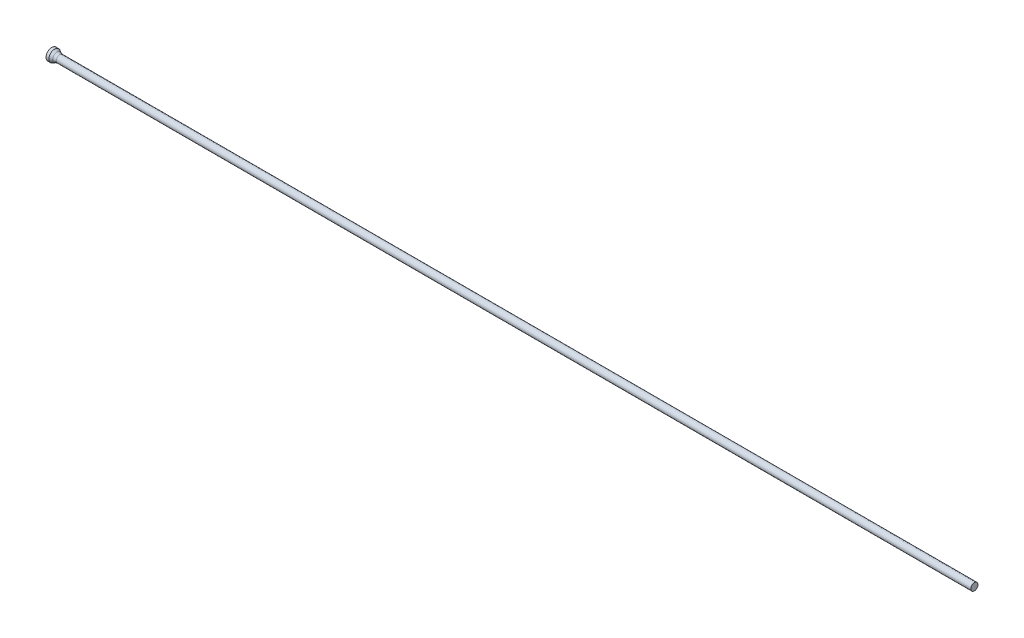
ISO-10303-21;
HEADER;
FILE_DESCRIPTION(('STEP AP214'),'2;1');
FILE_NAME('part.step','',(''),(''),'','','');
FILE_SCHEMA(('AUTOMOTIVE_DESIGN { 1 0 10303 214 1 1 1 1 }'));
ENDSEC;
DATA;
#1=APPLICATION_CONTEXT('core data for automotive mechanical design processes');
#2=APPLICATION_PROTOCOL_DEFINITION('international standard','automotive_design',2000,#1);
#3=PRODUCT_CONTEXT('',#1,'mechanical');
#4=PRODUCT('Part','Part','',(#3));
#5=PRODUCT_RELATED_PRODUCT_CATEGORY('part','',(#4));
#6=PRODUCT_DEFINITION_FORMATION('','',#4);
#7=PRODUCT_DEFINITION_CONTEXT('part definition',#1,'design');
#8=PRODUCT_DEFINITION('design','',#6,#7);
#9=PRODUCT_DEFINITION_SHAPE('','',#8);
#10=(LENGTH_UNIT() NAMED_UNIT(*) SI_UNIT(.MILLI.,.METRE.));
#11=(NAMED_UNIT(*) PLANE_ANGLE_UNIT() SI_UNIT($,.RADIAN.));
#12=(NAMED_UNIT(*) SI_UNIT($,.STERADIAN.) SOLID_ANGLE_UNIT());
#13=UNCERTAINTY_MEASURE_WITH_UNIT(LENGTH_MEASURE(1.E-05),#10,'distance_accuracy_value','');
#14=(GEOMETRIC_REPRESENTATION_CONTEXT(3) GLOBAL_UNCERTAINTY_ASSIGNED_CONTEXT((#13)) GLOBAL_UNIT_ASSIGNED_CONTEXT((#10,
#11,#12)) REPRESENTATION_CONTEXT('',''));
#15=CARTESIAN_POINT('',(0.,0.,0.));
#16=DIRECTION('',(0.,0.,1.));
#17=DIRECTION('',(1.,0.,0.));
#18=AXIS2_PLACEMENT_3D('',#15,#16,#17);
#19=CARTESIAN_POINT('',(0.,0.,0.));
#20=DIRECTION('',(1.,0.,0.));
#21=DIRECTION('',(0.,0.,-1.));
#22=AXIS2_PLACEMENT_3D('',#19,#20,#21);
#23=PLANE('',#22);
#24=CARTESIAN_POINT('',(0.,0.,0.));
#25=DIRECTION('',(-1.,0.,0.));
#26=DIRECTION('',(0.,0.,1.));
#27=AXIS2_PLACEMENT_3D('',#24,#25,#26);
#28=CIRCLE('',#27,1.);
#29=CARTESIAN_POINT('',(0.,0.,1.));
#30=VERTEX_POINT('',#29);
#31=EDGE_CURVE('E25',#30,#30,#28,.T.);
#32=ORIENTED_EDGE('',*,*,#31,.T.);
#33=EDGE_LOOP('',(#32));
#34=FACE_BOUND('',#33,.T.);
#35=ADVANCED_FACE('F14',(#34),#23,.F.);
#36=CARTESIAN_POINT('',(0.,0.,0.));
#37=DIRECTION('',(-1.,0.,0.));
#38=DIRECTION('',(0.,0.,1.));
#39=AXIS2_PLACEMENT_3D('',#36,#37,#38);
#40=CYLINDRICAL_SURFACE('',#39,1.);
#41=ORIENTED_EDGE('',*,*,#31,.F.);
#42=EDGE_LOOP('',(#41));
#43=FACE_BOUND('',#42,.T.);
#44=CARTESIAN_POINT('',(0.500480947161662,0.,0.));
#45=DIRECTION('',(-1.,0.,0.));
#46=DIRECTION('',(0.,0.,1.));
#47=AXIS2_PLACEMENT_3D('',#44,#45,#46);
#48=CIRCLE('',#47,1.);
#49=CARTESIAN_POINT('',(0.500480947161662,0.,1.));
#50=VERTEX_POINT('',#49);
#51=EDGE_CURVE('E29',#50,#50,#48,.T.);
#52=ORIENTED_EDGE('',*,*,#51,.T.);
#53=EDGE_LOOP('',(#52));
#54=FACE_BOUND('',#53,.T.);
#55=ADVANCED_FACE('F53',(#43,#54),#40,.T.);
#56=CARTESIAN_POINT('',(1.15,0.,0.));
#57=DIRECTION('',(-1.,0.,0.));
#58=DIRECTION('',(0.,0.,1.));
#59=AXIS2_PLACEMENT_3D('',#56,#57,#58);
#60=CONICAL_SURFACE('',#59,0.625,0.523598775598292);
#61=CARTESIAN_POINT('',(0.917949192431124,0.,0.));
#62=DIRECTION('',(-1.,0.,0.));
#63=DIRECTION('',(0.,0.,1.));
#64=AXIS2_PLACEMENT_3D('',#61,#62,#63);
#65=CIRCLE('',#64,0.758974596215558);
#66=CARTESIAN_POINT('',(0.917949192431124,0.,0.758974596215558));
#67=VERTEX_POINT('',#66);
#68=EDGE_CURVE('E21',#67,#67,#65,.T.);
#69=ORIENTED_EDGE('',*,*,#68,.T.);
#70=EDGE_LOOP('',(#69));
#71=FACE_BOUND('',#70,.T.);
#72=ORIENTED_EDGE('',*,*,#51,.F.);
#73=EDGE_LOOP('',(#72));
#74=FACE_BOUND('',#73,.T.);
#75=ADVANCED_FACE('F50',(#71,#74),#60,.T.);
#76=CARTESIAN_POINT('',(0.,0.,0.));
#77=DIRECTION('',(-1.,0.,0.));
#78=DIRECTION('',(0.,0.,1.));
#79=AXIS2_PLACEMENT_3D('',#76,#77,#78);
#80=CYLINDRICAL_SURFACE('',#79,0.625);
#81=CARTESIAN_POINT('',(1.41794919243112,0.,0.));
#82=DIRECTION('',(-1.,0.,0.));
#83=DIRECTION('',(0.,0.,1.));
#84=AXIS2_PLACEMENT_3D('',#81,#82,#83);
#85=CIRCLE('',#84,0.625);
#86=CARTESIAN_POINT('',(1.41794919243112,0.,0.625));
#87=VERTEX_POINT('',#86);
#88=EDGE_CURVE('E9',#87,#87,#85,.F.);
#89=ORIENTED_EDGE('',*,*,#88,.T.);
#90=EDGE_LOOP('',(#89));
#91=FACE_BOUND('',#90,.T.);
#92=CARTESIAN_POINT('',(160.,0.,0.));
#93=DIRECTION('',(-1.,0.,0.));
#94=DIRECTION('',(0.,0.,1.));
#95=AXIS2_PLACEMENT_3D('',#92,#93,#94);
#96=CIRCLE('',#95,0.625);
#97=CARTESIAN_POINT('',(160.,0.,0.625));
#98=VERTEX_POINT('',#97);
#99=EDGE_CURVE('E34',#98,#98,#96,.T.);
#100=ORIENTED_EDGE('',*,*,#99,.T.);
#101=EDGE_LOOP('',(#100));
#102=FACE_BOUND('',#101,.T.);
#103=ADVANCED_FACE('F38',(#91,#102),#80,.T.);
#104=CARTESIAN_POINT('',(160.,0.625,0.));
#105=DIRECTION('',(-1.,0.,0.));
#106=DIRECTION('',(0.,0.,1.));
#107=AXIS2_PLACEMENT_3D('',#104,#105,#106);
#108=PLANE('',#107);
#109=ORIENTED_EDGE('',*,*,#99,.F.);
#110=EDGE_LOOP('',(#109));
#111=FACE_BOUND('',#110,.T.);
#112=ADVANCED_FACE('F40',(#111),#108,.F.);
#113=CARTESIAN_POINT('',(1.41794919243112,0.,0.));
#114=DIRECTION('',(-1.,0.,0.));
#115=DIRECTION('',(0.,0.,1.));
#116=AXIS2_PLACEMENT_3D('',#113,#114,#115);
#117=TOROIDAL_SURFACE('',#116,1.625,1.);
#118=ORIENTED_EDGE('',*,*,#88,.F.);
#119=EDGE_LOOP('',(#118));
#120=FACE_BOUND('',#119,.T.);
#121=ORIENTED_EDGE('',*,*,#68,.F.);
#122=EDGE_LOOP('',(#121));
#123=FACE_BOUND('',#122,.T.);
#124=ADVANCED_FACE('F16',(#120,#123),#117,.F.);
#125=CLOSED_SHELL('',(#35,#55,#75,#103,#112,#124));
#126=MANIFOLD_SOLID_BREP('B1',#125);
#127=ADVANCED_BREP_SHAPE_REPRESENTATION('',(#18,#126),#14);
#128=SHAPE_DEFINITION_REPRESENTATION(#9,#127);
ENDSEC;
END-ISO-10303-21;
